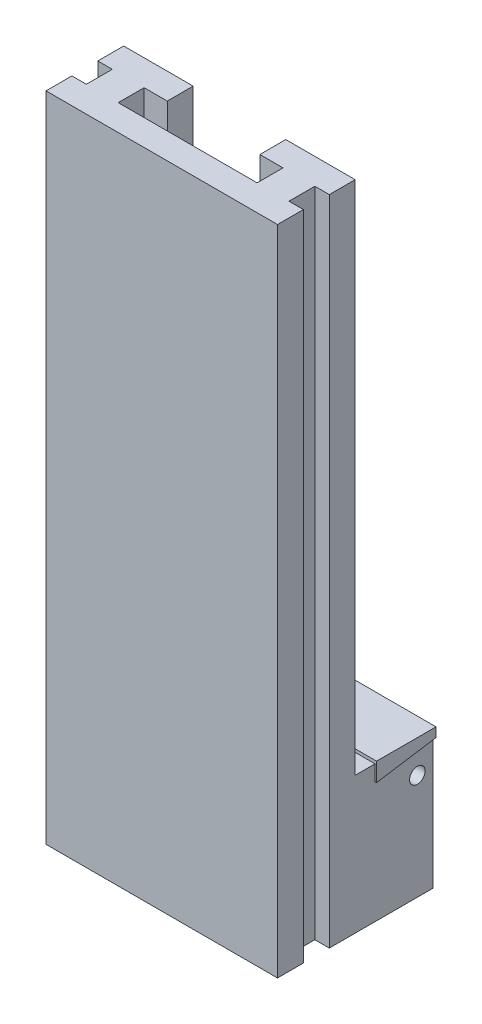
from build123d import *

# Parameters (mm, degrees)
GLISSIERE_DEPTH     = 420
SUPPORT_DEPTH       = 88
MORSFIXE_DEPTH      = 1
MORSFIXE_DEPTH_BACK = 150
ESQBUTEE_R          = 5
TROU_BUTEE_DEPTH    = 458.275628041


with BuildPart() as part:
    # EsqGlissiere → Glissiere (new body)
    with BuildSketch(Plane(origin=(0, 0, 0), x_dir=(1, 0, 0), z_dir=(0, 1, 0))):
        Polygon((-74.5, 0), (74.5, 0), (74.5, 16.666666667), (65.1875, 16.666666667), (65.1875, 33.333333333), (74.5, 33.333333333), (74.5, 50), (29.8, 50), (29.8, 33.333333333), (44.7, 33.333333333), (44.7, 16.666666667), (-44.7, 16.666666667), (-44.7, 33.333333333), (-29.8, 33.333333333), (-29.8, 50), (-74.5, 50), (-74.5, 33.333333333), (-65.1875, 33.333333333), (-65.1875, 16.666666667), (-74.5, 16.666666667), align=None)
    extrude(amount=GLISSIERE_DEPTH)

    # EsqSupport → Support (add)
    with BuildSketch(Plane.XZ):
        Polygon((-74.5, -50), (-74.5, -100), (74.5, -100), (74.5, -50), (29.8, -50), (29.8, -33.333333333), (44.7, -33.333333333), (44.7, -16.666666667), (-44.7, -16.666666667), (-44.7, -33.333333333), (-29.8, -33.333333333), (-29.8, -50), align=None)
    extrude(amount=-SUPPORT_DEPTH)

    # EsqMorsFixe → MorsFixe (add, two sides: drawn at the far end of the back side and taken through both)
    with BuildSketch(Plane.ZY.offset(74.5).offset(-MORSFIXE_DEPTH_BACK)):
        Polygon((-101, 84), (-101, 90), (-62.75, 90), (-62.75, 78), align=None)
    extrude(amount=MORSFIXE_DEPTH + MORSFIXE_DEPTH_BACK)

    # EsqButee → Trou Butee (cut, through all)
    with BuildSketch(Plane.ZY.offset(74.5)):
        with Locations((-90, 68)):
            Circle(ESQBUTEE_R)
    extrude(amount=-TROU_BUTEE_DEPTH, mode=Mode.SUBTRACT)


solid = part.part
